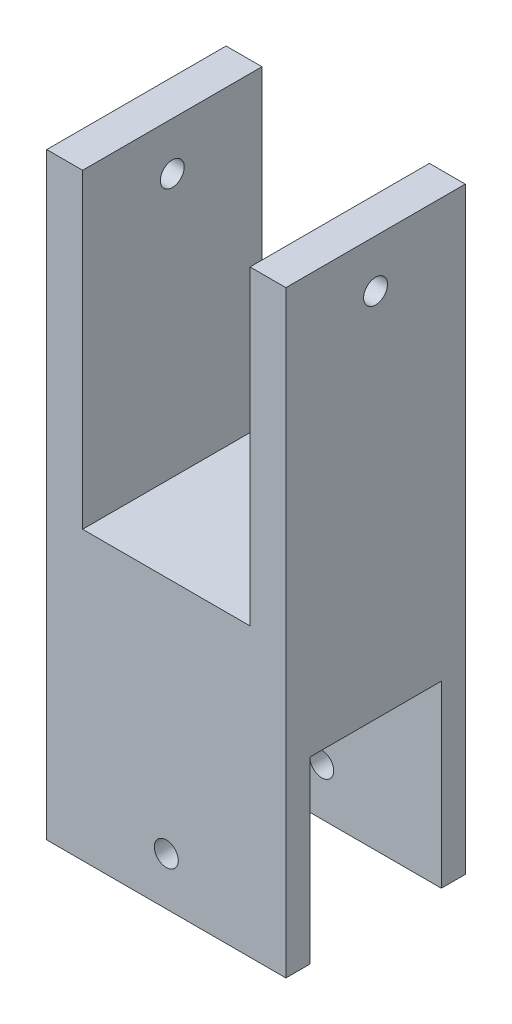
from build123d import *

# Parameters (mm, degrees)
ESQUISSE1_R                  = 3
BOSS_EXTRU_1_DEPTH           = 22.5
ENL_V_MAT_EXTRU_1_DEPTH      = 84.852549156
ENL_V_MAT_EXTRU_1_DEPTH_BACK = 84.852549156
ESQUISSE2_R                  = 3
ESQUISSE2_W                  = 33
ESQUISSE2_H                  = 45


with BuildPart() as part:
    # Esquisse1 → Boss.-Extru.1 (new, symmetric)
    with BuildSketch(Plane.XY):
        Polygon((-21, 75), (-30, 75), (-30, -75), (30, -75), (30, 75), (21, 75), (21, -3), (-21, -3), align=None)
        with Locations(Location((0, -63, 0), (0, 0, 180))):
            Circle(ESQUISSE1_R, mode=Mode.SUBTRACT)
    extrude(amount=BOSS_EXTRU_1_DEPTH, both=True)

    # Esquisse2 → Enl_v. mat.-Extru.1 (cut, two sides: drawn at the far end of the back side and taken through both)
    with BuildSketch(Plane(origin=(0, 0, 0), x_dir=(0, 0, -1), z_dir=(1, 0, 0)).offset(-ENL_V_MAT_EXTRU_1_DEPTH_BACK)):
        with Locations((0, 63)):
            Circle(ESQUISSE2_R)
        with Locations((0, -52.5)):
            Rectangle(ESQUISSE2_W, ESQUISSE2_H)
    extrude(amount=ENL_V_MAT_EXTRU_1_DEPTH + ENL_V_MAT_EXTRU_1_DEPTH_BACK, mode=Mode.SUBTRACT)


solid = part.part
